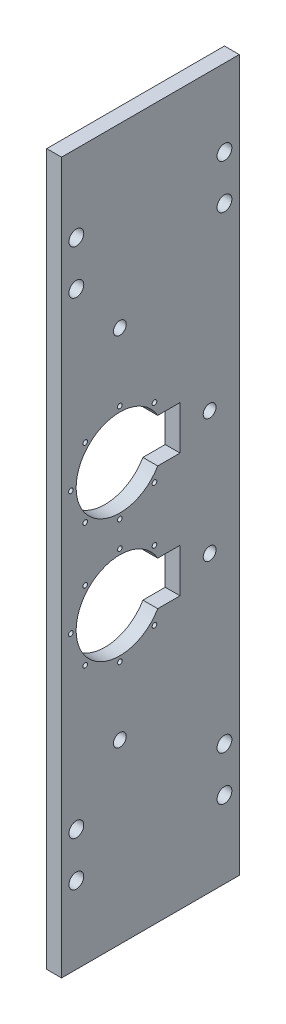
from build123d import *

# Parameters (mm, degrees)
SKETCH1_W              = 609.6
SKETCH1_H              = 152.4
SKETCH1_R              = 2
SKETCH1_R_2            = 6.35
BOSS_EXTRUDE1_DEPTH    = 6.35
M12X1_0_TAPPED_HOLE1_D = 11


with BuildPart() as part:
    # Sketch1 → Boss-Extrude1 (new, symmetric)
    with BuildSketch(Plane.YZ):
        Rectangle(SKETCH1_W, SKETCH1_H)
        with Locations(Location((53, 68.2, 0), (0, 0, 270))):
            Circle(SKETCH1_R, mode=Mode.SUBTRACT)
        with Locations(Location((82.69848481, 55.89848481, 0), (0, 0, 270))):
            Circle(SKETCH1_R, mode=Mode.SUBTRACT)
        with Locations(Location((95, 26.2, 0), (0, 0, 270))):
            Circle(SKETCH1_R, mode=Mode.SUBTRACT)
        with Locations(Location((82.69848481, -3.49848481, 0), (0, 0, 270))):
            Circle(SKETCH1_R, mode=Mode.SUBTRACT)
        with Locations(Location((23.30151519, -3.49848481, 0), (0, 0, 270))):
            Circle(SKETCH1_R, mode=Mode.SUBTRACT)
        with Locations(Location((11, 26.2, 0), (0, 0, 270))):
            Circle(SKETCH1_R, mode=Mode.SUBTRACT)
        with Locations(Location((23.30151519, 55.89848481, 0), (0, 0, 270))):
            Circle(SKETCH1_R, mode=Mode.SUBTRACT)
        with Locations(Location((238.76, 63.5, 0), (0, 0, 270))):
            Circle(SKETCH1_R_2, mode=Mode.SUBTRACT)
        with Locations(Location((200.66, 63.5, 0), (0, 0, 270))):
            Circle(SKETCH1_R_2, mode=Mode.SUBTRACT)
        with Locations(Location((200.66, -63.5, 0), (0, 0, 90))):
            Circle(SKETCH1_R_2, mode=Mode.SUBTRACT)
        with Locations(Location((238.76, -63.5, 0), (0, 0, 90))):
            Circle(SKETCH1_R_2, mode=Mode.SUBTRACT)
        with Locations(Location((-200.66, 63.5, 0), (0, 0, 90))):
            Circle(SKETCH1_R_2, mode=Mode.SUBTRACT)
        with Locations(Location((-238.76, 63.5, 0), (0, 0, 90))):
            Circle(SKETCH1_R_2, mode=Mode.SUBTRACT)
        with Locations(Location((-238.76, -63.5, 0), (0, 0, 270))):
            Circle(SKETCH1_R_2, mode=Mode.SUBTRACT)
        with Locations(Location((-200.66, -63.5, 0), (0, 0, 270))):
            Circle(SKETCH1_R_2, mode=Mode.SUBTRACT)
        with Locations(Location((-82.69848481, -3.49848481, 0), (0, 0, 90))):
            Circle(SKETCH1_R, mode=Mode.SUBTRACT)
        with Locations(Location((-95, 26.2, 0), (0, 0, 90))):
            Circle(SKETCH1_R, mode=Mode.SUBTRACT)
        with Locations(Location((-82.69848481, 55.89848481, 0), (0, 0, 90))):
            Circle(SKETCH1_R, mode=Mode.SUBTRACT)
        with Locations(Location((-53, 68.2, 0), (0, 0, 90))):
            Circle(SKETCH1_R, mode=Mode.SUBTRACT)
        with Locations(Location((-23.30151519, 55.89848481, 0), (0, 0, 90))):
            Circle(SKETCH1_R, mode=Mode.SUBTRACT)
        with Locations(Location((-11, 26.2, 0), (0, 0, 90))):
            Circle(SKETCH1_R, mode=Mode.SUBTRACT)
        with Locations(Location((-23.30151519, -3.49848481, 0), (0, 0, 90))):
            Circle(SKETCH1_R, mode=Mode.SUBTRACT)
        with BuildLine():
            Line((34.25, -6.275952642), (34.25, -25.4))
            Line((34.25, -25.4), (71.75, -25.4))
            Line((71.75, -25.4), (71.75, -6.275952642))
            ThreePointArc((71.75, -6.275952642), (53, 63.7), (34.25, -6.275952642))
        make_face(mode=Mode.SUBTRACT)
        with BuildLine():
            Line((-34.25, -25.4), (-71.75, -25.4))
            Line((-71.75, -25.4), (-71.75, -6.275952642))
            ThreePointArc((-71.75, -6.275952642), (-53, 63.7), (-34.25, -6.275952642))
            Line((-34.25, -6.275952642), (-34.25, -25.4))
        make_face(mode=Mode.SUBTRACT)
    extrude(amount=BOSS_EXTRUDE1_DEPTH, both=True)

    # M12x1.0 Tapped Hole1 (through all)
    with Locations(Plane(origin=(6.35, 0, 0), x_dir=(0, 0, -1), z_dir=(1, 0, 0))):
        with Locations((50.8, 53), (-26.2, 153), (50.8, -53), (-26.2, -153)):
            Hole(M12X1_0_TAPPED_HOLE1_D / 2)


solid = part.part
